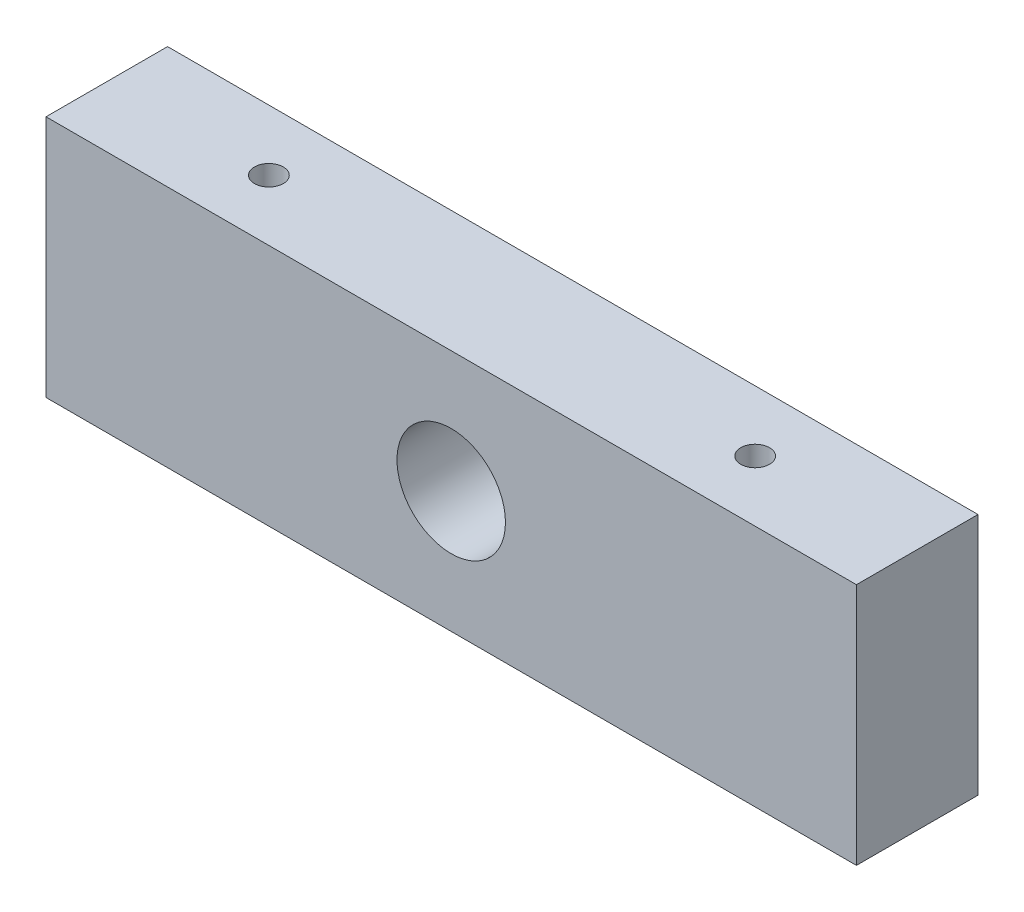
from build123d import *

# Parameters (mm, degrees)
SKETCH1_W              = 63.5
SKETCH1_H              = 9.525
BOSS_EXTRUDE1_DEPTH    = 19.05
M10X1_5_TAPPED_HOLE1_D = 8.5
F_4_40_TAPPED_HOLE1_D  = 2.2606


with BuildPart() as part:
    # Sketch1 → Boss-Extrude1 (new body)
    with BuildSketch(Plane(origin=(0, 0, 0), x_dir=(1, 0, 0), z_dir=(0, 1, 0))):
        with Locations((31.75, 4.7625)):
            Rectangle(SKETCH1_W, SKETCH1_H)
    extrude(amount=BOSS_EXTRUDE1_DEPTH)

    # M10x1.5 Tapped Hole1 (through all)
    with Locations(Plane.XY):
        with Locations((31.75, 9.525)):
            Hole(M10X1_5_TAPPED_HOLE1_D / 2)

    # 4-40 Tapped Hole1 (through all)
    with Locations(Plane(origin=(0, 19.05, 0), x_dir=(1, 0, 0), z_dir=(0, 1, 0))):
        with Locations((50.8, 4.7625), (12.7, 4.7625)):
            Hole(F_4_40_TAPPED_HOLE1_D / 2)


solid = part.part
